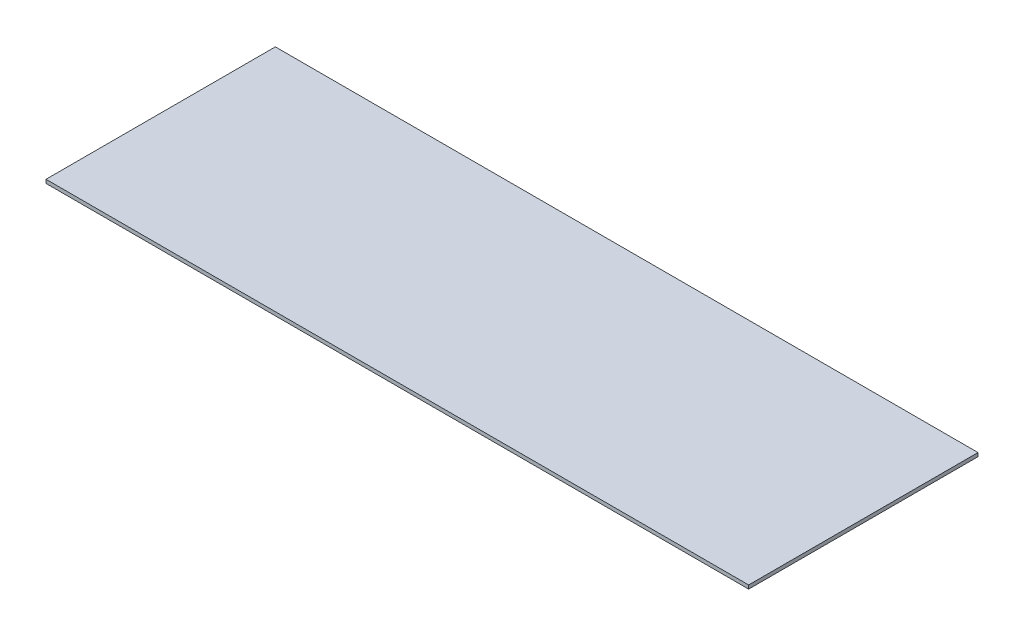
from build123d import *

# Parameters (mm, degrees)
SKETCH1_W            = 2.3622
SKETCH1_H            = 149.225
PANEL_OR_BLOCK_DEPTH = 457.2


with BuildPart() as part:
    # Sketch1 → Panel_or_block (new body)
    with BuildSketch(Plane.YZ):
        with Locations((-77.3811, -1.5875)):
            Rectangle(SKETCH1_W, SKETCH1_H)
    extrude(amount=PANEL_OR_BLOCK_DEPTH)


solid = part.part
